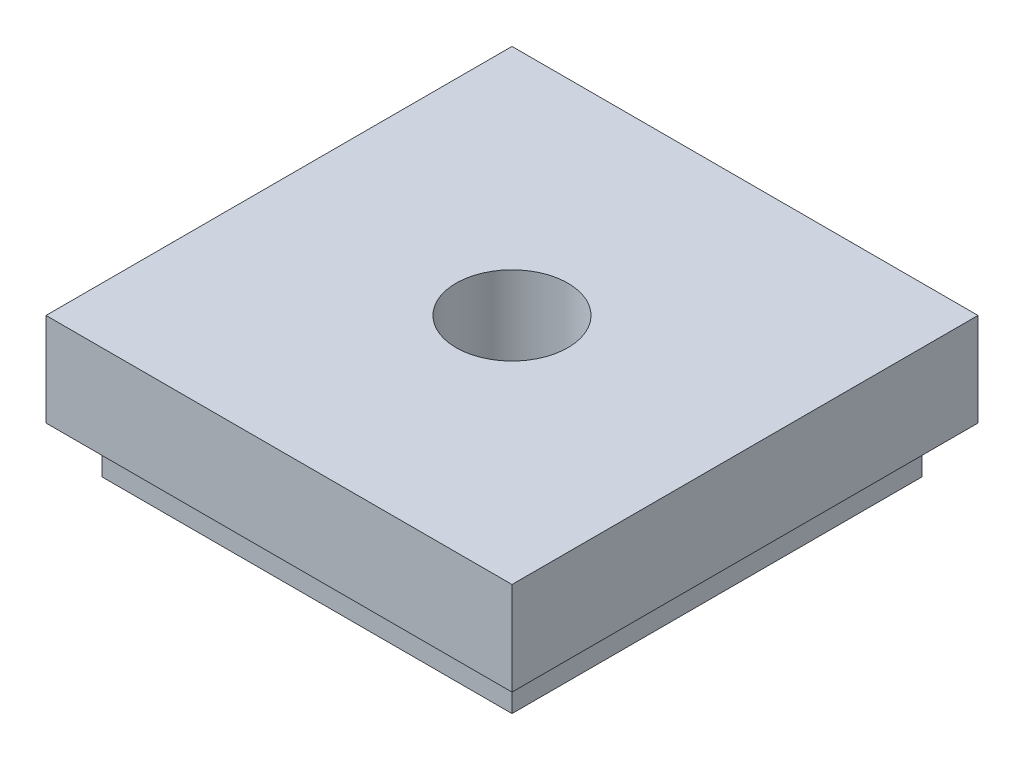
ISO-10303-21;
HEADER;
FILE_DESCRIPTION(('STEP AP214'),'2;1');
FILE_NAME('part.step','',(''),(''),'','','');
FILE_SCHEMA(('AUTOMOTIVE_DESIGN { 1 0 10303 214 1 1 1 1 }'));
ENDSEC;
DATA;
#1=APPLICATION_CONTEXT('core data for automotive mechanical design processes');
#2=APPLICATION_PROTOCOL_DEFINITION('international standard','automotive_design',2000,#1);
#3=PRODUCT_CONTEXT('',#1,'mechanical');
#4=PRODUCT('Part','Part','',(#3));
#5=PRODUCT_RELATED_PRODUCT_CATEGORY('part','',(#4));
#6=PRODUCT_DEFINITION_FORMATION('','',#4);
#7=PRODUCT_DEFINITION_CONTEXT('part definition',#1,'design');
#8=PRODUCT_DEFINITION('design','',#6,#7);
#9=PRODUCT_DEFINITION_SHAPE('','',#8);
#10=(LENGTH_UNIT() NAMED_UNIT(*) SI_UNIT(.MILLI.,.METRE.));
#11=(NAMED_UNIT(*) PLANE_ANGLE_UNIT() SI_UNIT($,.RADIAN.));
#12=(NAMED_UNIT(*) SI_UNIT($,.STERADIAN.) SOLID_ANGLE_UNIT());
#13=UNCERTAINTY_MEASURE_WITH_UNIT(LENGTH_MEASURE(1.E-05),#10,'distance_accuracy_value','');
#14=(GEOMETRIC_REPRESENTATION_CONTEXT(3) GLOBAL_UNCERTAINTY_ASSIGNED_CONTEXT((#13)) GLOBAL_UNIT_ASSIGNED_CONTEXT((#10,
#11,#12)) REPRESENTATION_CONTEXT('',''));
#15=CARTESIAN_POINT('',(0.,0.,0.));
#16=DIRECTION('',(0.,0.,1.));
#17=DIRECTION('',(1.,0.,0.));
#18=AXIS2_PLACEMENT_3D('',#15,#16,#17);
#19=CARTESIAN_POINT('',(50.,0.,0.));
#20=DIRECTION('',(0.,-1.,0.));
#21=DIRECTION('',(0.,0.,-1.));
#22=AXIS2_PLACEMENT_3D('',#19,#20,#21);
#23=PLANE('',#22);
#24=DIRECTION('',(0.,0.,-1.));
#25=VECTOR('',#24,1.);
#26=CARTESIAN_POINT('',(50.,0.,-50.));
#27=LINE('',#26,#25);
#28=CARTESIAN_POINT('',(50.,0.,0.));
#29=VERTEX_POINT('',#28);
#30=CARTESIAN_POINT('',(50.,0.,-50.));
#31=VERTEX_POINT('',#30);
#32=EDGE_CURVE('E190',#29,#31,#27,.T.);
#33=ORIENTED_EDGE('',*,*,#32,.F.);
#34=DIRECTION('',(1.,0.,0.));
#35=VECTOR('',#34,1.);
#36=CARTESIAN_POINT('',(50.,0.,0.));
#37=LINE('',#36,#35);
#38=CARTESIAN_POINT('',(0.,0.,0.));
#39=VERTEX_POINT('',#38);
#40=EDGE_CURVE('E195',#39,#29,#37,.T.);
#41=ORIENTED_EDGE('',*,*,#40,.F.);
#42=DIRECTION('',(0.,0.,1.));
#43=VECTOR('',#42,1.);
#44=CARTESIAN_POINT('',(0.,0.,-50.));
#45=LINE('',#44,#43);
#46=CARTESIAN_POINT('',(0.,0.,-50.));
#47=VERTEX_POINT('',#46);
#48=EDGE_CURVE('E206',#47,#39,#45,.T.);
#49=ORIENTED_EDGE('',*,*,#48,.F.);
#50=DIRECTION('',(-1.,0.,0.));
#51=VECTOR('',#50,1.);
#52=CARTESIAN_POINT('',(50.,0.,-50.));
#53=LINE('',#52,#51);
#54=EDGE_CURVE('E204',#31,#47,#53,.T.);
#55=ORIENTED_EDGE('',*,*,#54,.F.);
#56=EDGE_LOOP('',(#33,#41,#49,#55));
#57=FACE_BOUND('',#56,.T.);
#58=DIRECTION('',(1.,0.,0.));
#59=VECTOR('',#58,1.);
#60=CARTESIAN_POINT('',(3.,0.,-47.));
#61=LINE('',#60,#59);
#62=CARTESIAN_POINT('',(3.,0.,-47.));
#63=VERTEX_POINT('',#62);
#64=CARTESIAN_POINT('',(47.,0.,-47.));
#65=VERTEX_POINT('',#64);
#66=EDGE_CURVE('E177',#63,#65,#61,.T.);
#67=ORIENTED_EDGE('',*,*,#66,.F.);
#68=DIRECTION('',(0.,0.,-1.));
#69=VECTOR('',#68,1.);
#70=CARTESIAN_POINT('',(3.,0.,-3.));
#71=LINE('',#70,#69);
#72=CARTESIAN_POINT('',(3.,0.,-3.));
#73=VERTEX_POINT('',#72);
#74=EDGE_CURVE('E140',#73,#63,#71,.T.);
#75=ORIENTED_EDGE('',*,*,#74,.F.);
#76=DIRECTION('',(-1.,0.,0.));
#77=VECTOR('',#76,1.);
#78=CARTESIAN_POINT('',(3.,0.,-3.));
#79=LINE('',#78,#77);
#80=CARTESIAN_POINT('',(47.,0.,-3.));
#81=VERTEX_POINT('',#80);
#82=EDGE_CURVE('E168',#81,#73,#79,.T.);
#83=ORIENTED_EDGE('',*,*,#82,.F.);
#84=DIRECTION('',(0.,0.,1.));
#85=VECTOR('',#84,1.);
#86=CARTESIAN_POINT('',(47.,0.,-3.));
#87=LINE('',#86,#85);
#88=EDGE_CURVE('E179',#65,#81,#87,.T.);
#89=ORIENTED_EDGE('',*,*,#88,.F.);
#90=EDGE_LOOP('',(#67,#75,#83,#89));
#91=FACE_BOUND('',#90,.T.);
#92=ADVANCED_FACE('F32',(#57,#91),#23,.T.);
#93=CARTESIAN_POINT('',(50.,10.,-50.));
#94=DIRECTION('',(-1.,0.,0.));
#95=DIRECTION('',(0.,0.,1.));
#96=AXIS2_PLACEMENT_3D('',#93,#94,#95);
#97=PLANE('',#96);
#98=ORIENTED_EDGE('',*,*,#32,.T.);
#99=DIRECTION('',(0.,-1.,0.));
#100=VECTOR('',#99,1.);
#101=CARTESIAN_POINT('',(50.,10.,-50.));
#102=LINE('',#101,#100);
#103=CARTESIAN_POINT('',(50.,10.,-50.));
#104=VERTEX_POINT('',#103);
#105=EDGE_CURVE('E11',#104,#31,#102,.T.);
#106=ORIENTED_EDGE('',*,*,#105,.F.);
#107=DIRECTION('',(0.,0.,-1.));
#108=VECTOR('',#107,1.);
#109=CARTESIAN_POINT('',(50.,10.,-50.));
#110=LINE('',#109,#108);
#111=CARTESIAN_POINT('',(50.,10.,0.));
#112=VERTEX_POINT('',#111);
#113=EDGE_CURVE('E191',#112,#104,#110,.T.);
#114=ORIENTED_EDGE('',*,*,#113,.F.);
#115=DIRECTION('',(0.,-1.,0.));
#116=VECTOR('',#115,1.);
#117=CARTESIAN_POINT('',(50.,10.,0.));
#118=LINE('',#117,#116);
#119=EDGE_CURVE('E201',#112,#29,#118,.T.);
#120=ORIENTED_EDGE('',*,*,#119,.T.);
#121=EDGE_LOOP('',(#98,#106,#114,#120));
#122=FACE_BOUND('',#121,.T.);
#123=ADVANCED_FACE('F34',(#122),#97,.F.);
#124=CARTESIAN_POINT('',(50.,10.,-50.));
#125=DIRECTION('',(0.,0.,1.));
#126=DIRECTION('',(1.,0.,0.));
#127=AXIS2_PLACEMENT_3D('',#124,#125,#126);
#128=PLANE('',#127);
#129=ORIENTED_EDGE('',*,*,#54,.T.);
#130=DIRECTION('',(0.,-1.,0.));
#131=VECTOR('',#130,1.);
#132=CARTESIAN_POINT('',(0.,10.,-50.));
#133=LINE('',#132,#131);
#134=CARTESIAN_POINT('',(0.,10.,-50.));
#135=VERTEX_POINT('',#134);
#136=EDGE_CURVE('E40',#135,#47,#133,.T.);
#137=ORIENTED_EDGE('',*,*,#136,.F.);
#138=DIRECTION('',(-1.,0.,0.));
#139=VECTOR('',#138,1.);
#140=CARTESIAN_POINT('',(50.,10.,-50.));
#141=LINE('',#140,#139);
#142=EDGE_CURVE('E194',#104,#135,#141,.T.);
#143=ORIENTED_EDGE('',*,*,#142,.F.);
#144=ORIENTED_EDGE('',*,*,#105,.T.);
#145=EDGE_LOOP('',(#129,#137,#143,#144));
#146=FACE_BOUND('',#145,.T.);
#147=ADVANCED_FACE('F234',(#146),#128,.F.);
#148=CARTESIAN_POINT('',(0.,10.,-50.));
#149=DIRECTION('',(1.,0.,0.));
#150=DIRECTION('',(0.,0.,-1.));
#151=AXIS2_PLACEMENT_3D('',#148,#149,#150);
#152=PLANE('',#151);
#153=ORIENTED_EDGE('',*,*,#48,.T.);
#154=DIRECTION('',(0.,-1.,0.));
#155=VECTOR('',#154,1.);
#156=CARTESIAN_POINT('',(0.,10.,0.));
#157=LINE('',#156,#155);
#158=CARTESIAN_POINT('',(0.,10.,0.));
#159=VERTEX_POINT('',#158);
#160=EDGE_CURVE('E211',#159,#39,#157,.T.);
#161=ORIENTED_EDGE('',*,*,#160,.F.);
#162=DIRECTION('',(0.,0.,1.));
#163=VECTOR('',#162,1.);
#164=CARTESIAN_POINT('',(0.,10.,-50.));
#165=LINE('',#164,#163);
#166=EDGE_CURVE('E197',#135,#159,#165,.T.);
#167=ORIENTED_EDGE('',*,*,#166,.F.);
#168=ORIENTED_EDGE('',*,*,#136,.T.);
#169=EDGE_LOOP('',(#153,#161,#167,#168));
#170=FACE_BOUND('',#169,.T.);
#171=ADVANCED_FACE('F218',(#170),#152,.F.);
#172=CARTESIAN_POINT('',(50.,10.,0.));
#173=DIRECTION('',(0.,0.,-1.));
#174=DIRECTION('',(-1.,0.,0.));
#175=AXIS2_PLACEMENT_3D('',#172,#173,#174);
#176=PLANE('',#175);
#177=ORIENTED_EDGE('',*,*,#40,.T.);
#178=ORIENTED_EDGE('',*,*,#119,.F.);
#179=DIRECTION('',(1.,0.,0.));
#180=VECTOR('',#179,1.);
#181=CARTESIAN_POINT('',(50.,10.,0.));
#182=LINE('',#181,#180);
#183=EDGE_CURVE('E199',#159,#112,#182,.T.);
#184=ORIENTED_EDGE('',*,*,#183,.F.);
#185=ORIENTED_EDGE('',*,*,#160,.T.);
#186=EDGE_LOOP('',(#177,#178,#184,#185));
#187=FACE_BOUND('',#186,.T.);
#188=ADVANCED_FACE('F227',(#187),#176,.F.);
#189=CARTESIAN_POINT('',(50.,10.,0.));
#190=DIRECTION('',(0.,-1.,0.));
#191=DIRECTION('',(0.,0.,-1.));
#192=AXIS2_PLACEMENT_3D('',#189,#190,#191);
#193=PLANE('',#192);
#194=CARTESIAN_POINT('',(25.,10.,-25.));
#195=DIRECTION('',(0.,1.,0.));
#196=DIRECTION('',(0.,0.,1.));
#197=AXIS2_PLACEMENT_3D('',#194,#195,#196);
#198=CIRCLE('',#197,6.);
#199=CARTESIAN_POINT('',(25.,10.,-19.));
#200=VERTEX_POINT('',#199);
#201=EDGE_CURVE('E263',#200,#200,#198,.T.);
#202=ORIENTED_EDGE('',*,*,#201,.F.);
#203=EDGE_LOOP('',(#202));
#204=FACE_BOUND('',#203,.T.);
#205=ORIENTED_EDGE('',*,*,#113,.T.);
#206=ORIENTED_EDGE('',*,*,#142,.T.);
#207=ORIENTED_EDGE('',*,*,#166,.T.);
#208=ORIENTED_EDGE('',*,*,#183,.T.);
#209=EDGE_LOOP('',(#205,#206,#207,#208));
#210=FACE_BOUND('',#209,.T.);
#211=ADVANCED_FACE('F233',(#204,#210),#193,.F.);
#212=CARTESIAN_POINT('',(3.,-5.,-47.));
#213=DIRECTION('',(0.,-1.,0.));
#214=DIRECTION('',(0.,0.,-1.));
#215=AXIS2_PLACEMENT_3D('',#212,#213,#214);
#216=PLANE('',#215);
#217=DIRECTION('',(0.,0.,-1.));
#218=VECTOR('',#217,1.);
#219=CARTESIAN_POINT('',(3.,-5.,-3.));
#220=LINE('',#219,#218);
#221=CARTESIAN_POINT('',(3.,-5.,-3.));
#222=VERTEX_POINT('',#221);
#223=CARTESIAN_POINT('',(3.,-5.,-47.));
#224=VERTEX_POINT('',#223);
#225=EDGE_CURVE('E164',#222,#224,#220,.T.);
#226=ORIENTED_EDGE('',*,*,#225,.T.);
#227=DIRECTION('',(1.,0.,0.));
#228=VECTOR('',#227,1.);
#229=CARTESIAN_POINT('',(3.,-5.,-47.));
#230=LINE('',#229,#228);
#231=CARTESIAN_POINT('',(47.,-5.,-47.));
#232=VERTEX_POINT('',#231);
#233=EDGE_CURVE('E167',#224,#232,#230,.T.);
#234=ORIENTED_EDGE('',*,*,#233,.T.);
#235=DIRECTION('',(0.,0.,1.));
#236=VECTOR('',#235,1.);
#237=CARTESIAN_POINT('',(47.,-5.,-3.));
#238=LINE('',#237,#236);
#239=CARTESIAN_POINT('',(47.,-5.,-3.));
#240=VERTEX_POINT('',#239);
#241=EDGE_CURVE('E170',#232,#240,#238,.T.);
#242=ORIENTED_EDGE('',*,*,#241,.T.);
#243=DIRECTION('',(-1.,0.,0.));
#244=VECTOR('',#243,1.);
#245=CARTESIAN_POINT('',(3.,-5.,-3.));
#246=LINE('',#245,#244);
#247=EDGE_CURVE('E172',#240,#222,#246,.T.);
#248=ORIENTED_EDGE('',*,*,#247,.T.);
#249=EDGE_LOOP('',(#226,#234,#242,#248));
#250=FACE_BOUND('',#249,.T.);
#251=DIRECTION('',(1.,0.,0.));
#252=VECTOR('',#251,1.);
#253=CARTESIAN_POINT('',(5.,-5.,-45.));
#254=LINE('',#253,#252);
#255=CARTESIAN_POINT('',(5.,-5.,-45.));
#256=VERTEX_POINT('',#255);
#257=CARTESIAN_POINT('',(45.,-5.,-45.));
#258=VERTEX_POINT('',#257);
#259=EDGE_CURVE('E132',#256,#258,#254,.T.);
#260=ORIENTED_EDGE('',*,*,#259,.F.);
#261=DIRECTION('',(0.,0.,-1.));
#262=VECTOR('',#261,1.);
#263=CARTESIAN_POINT('',(5.,-5.,-5.));
#264=LINE('',#263,#262);
#265=CARTESIAN_POINT('',(5.,-5.,-5.));
#266=VERTEX_POINT('',#265);
#267=EDGE_CURVE('E123',#266,#256,#264,.T.);
#268=ORIENTED_EDGE('',*,*,#267,.F.);
#269=DIRECTION('',(-1.,0.,0.));
#270=VECTOR('',#269,1.);
#271=CARTESIAN_POINT('',(5.,-5.,-5.));
#272=LINE('',#271,#270);
#273=CARTESIAN_POINT('',(45.,-5.,-5.));
#274=VERTEX_POINT('',#273);
#275=EDGE_CURVE('E148',#274,#266,#272,.T.);
#276=ORIENTED_EDGE('',*,*,#275,.F.);
#277=DIRECTION('',(0.,0.,1.));
#278=VECTOR('',#277,1.);
#279=CARTESIAN_POINT('',(45.,-5.,-5.));
#280=LINE('',#279,#278);
#281=EDGE_CURVE('E146',#258,#274,#280,.T.);
#282=ORIENTED_EDGE('',*,*,#281,.F.);
#283=EDGE_LOOP('',(#260,#268,#276,#282));
#284=FACE_BOUND('',#283,.T.);
#285=ADVANCED_FACE('F144',(#250,#284),#216,.T.);
#286=CARTESIAN_POINT('',(3.,-5.,-3.));
#287=DIRECTION('',(1.,0.,0.));
#288=DIRECTION('',(0.,0.,-1.));
#289=AXIS2_PLACEMENT_3D('',#286,#287,#288);
#290=PLANE('',#289);
#291=ORIENTED_EDGE('',*,*,#74,.T.);
#292=DIRECTION('',(0.,1.,0.));
#293=VECTOR('',#292,1.);
#294=CARTESIAN_POINT('',(3.,-5.,-47.));
#295=LINE('',#294,#293);
#296=EDGE_CURVE('E188',#224,#63,#295,.T.);
#297=ORIENTED_EDGE('',*,*,#296,.F.);
#298=ORIENTED_EDGE('',*,*,#225,.F.);
#299=DIRECTION('',(0.,1.,0.));
#300=VECTOR('',#299,1.);
#301=CARTESIAN_POINT('',(3.,-5.,-3.));
#302=LINE('',#301,#300);
#303=EDGE_CURVE('E174',#222,#73,#302,.T.);
#304=ORIENTED_EDGE('',*,*,#303,.T.);
#305=EDGE_LOOP('',(#291,#297,#298,#304));
#306=FACE_BOUND('',#305,.T.);
#307=ADVANCED_FACE('F274',(#306),#290,.F.);
#308=CARTESIAN_POINT('',(3.,-5.,-47.));
#309=DIRECTION('',(0.,0.,1.));
#310=DIRECTION('',(1.,0.,0.));
#311=AXIS2_PLACEMENT_3D('',#308,#309,#310);
#312=PLANE('',#311);
#313=ORIENTED_EDGE('',*,*,#66,.T.);
#314=DIRECTION('',(0.,1.,0.));
#315=VECTOR('',#314,1.);
#316=CARTESIAN_POINT('',(47.,-5.,-47.));
#317=LINE('',#316,#315);
#318=EDGE_CURVE('E185',#232,#65,#317,.T.);
#319=ORIENTED_EDGE('',*,*,#318,.F.);
#320=ORIENTED_EDGE('',*,*,#233,.F.);
#321=ORIENTED_EDGE('',*,*,#296,.T.);
#322=EDGE_LOOP('',(#313,#319,#320,#321));
#323=FACE_BOUND('',#322,.T.);
#324=ADVANCED_FACE('F280',(#323),#312,.F.);
#325=CARTESIAN_POINT('',(47.,-5.,-3.));
#326=DIRECTION('',(-1.,0.,0.));
#327=DIRECTION('',(0.,0.,1.));
#328=AXIS2_PLACEMENT_3D('',#325,#326,#327);
#329=PLANE('',#328);
#330=ORIENTED_EDGE('',*,*,#88,.T.);
#331=DIRECTION('',(0.,1.,0.));
#332=VECTOR('',#331,1.);
#333=CARTESIAN_POINT('',(47.,-5.,-3.));
#334=LINE('',#333,#332);
#335=EDGE_CURVE('E47',#240,#81,#334,.T.);
#336=ORIENTED_EDGE('',*,*,#335,.F.);
#337=ORIENTED_EDGE('',*,*,#241,.F.);
#338=ORIENTED_EDGE('',*,*,#318,.T.);
#339=EDGE_LOOP('',(#330,#336,#337,#338));
#340=FACE_BOUND('',#339,.T.);
#341=ADVANCED_FACE('F284',(#340),#329,.F.);
#342=CARTESIAN_POINT('',(3.,-5.,-3.));
#343=DIRECTION('',(0.,0.,-1.));
#344=DIRECTION('',(-1.,0.,0.));
#345=AXIS2_PLACEMENT_3D('',#342,#343,#344);
#346=PLANE('',#345);
#347=ORIENTED_EDGE('',*,*,#82,.T.);
#348=ORIENTED_EDGE('',*,*,#303,.F.);
#349=ORIENTED_EDGE('',*,*,#247,.F.);
#350=ORIENTED_EDGE('',*,*,#335,.T.);
#351=EDGE_LOOP('',(#347,#348,#349,#350));
#352=FACE_BOUND('',#351,.T.);
#353=ADVANCED_FACE('F288',(#352),#346,.F.);
#354=CARTESIAN_POINT('',(5.,-5.,-5.));
#355=DIRECTION('',(1.,0.,0.));
#356=DIRECTION('',(0.,0.,-1.));
#357=AXIS2_PLACEMENT_3D('',#354,#355,#356);
#358=PLANE('',#357);
#359=DIRECTION('',(0.,0.,-1.));
#360=VECTOR('',#359,1.);
#361=CARTESIAN_POINT('',(5.,0.,-5.));
#362=LINE('',#361,#360);
#363=CARTESIAN_POINT('',(5.,0.,-5.));
#364=VERTEX_POINT('',#363);
#365=CARTESIAN_POINT('',(5.,0.,-45.));
#366=VERTEX_POINT('',#365);
#367=EDGE_CURVE('E55',#364,#366,#362,.T.);
#368=ORIENTED_EDGE('',*,*,#367,.F.);
#369=DIRECTION('',(0.,1.,0.));
#370=VECTOR('',#369,1.);
#371=CARTESIAN_POINT('',(5.,-5.,-5.));
#372=LINE('',#371,#370);
#373=EDGE_CURVE('E128',#266,#364,#372,.T.);
#374=ORIENTED_EDGE('',*,*,#373,.F.);
#375=ORIENTED_EDGE('',*,*,#267,.T.);
#376=DIRECTION('',(0.,1.,0.));
#377=VECTOR('',#376,1.);
#378=CARTESIAN_POINT('',(5.,-5.,-45.));
#379=LINE('',#378,#377);
#380=EDGE_CURVE('E126',#256,#366,#379,.T.);
#381=ORIENTED_EDGE('',*,*,#380,.T.);
#382=EDGE_LOOP('',(#368,#374,#375,#381));
#383=FACE_BOUND('',#382,.T.);
#384=ADVANCED_FACE('F125',(#383),#358,.T.);
#385=CARTESIAN_POINT('',(5.,-5.,-45.));
#386=DIRECTION('',(0.,0.,1.));
#387=DIRECTION('',(1.,0.,0.));
#388=AXIS2_PLACEMENT_3D('',#385,#386,#387);
#389=PLANE('',#388);
#390=DIRECTION('',(1.,0.,0.));
#391=VECTOR('',#390,1.);
#392=CARTESIAN_POINT('',(5.,0.,-45.));
#393=LINE('',#392,#391);
#394=CARTESIAN_POINT('',(45.,0.,-45.));
#395=VERTEX_POINT('',#394);
#396=EDGE_CURVE('E139',#366,#395,#393,.T.);
#397=ORIENTED_EDGE('',*,*,#396,.F.);
#398=ORIENTED_EDGE('',*,*,#380,.F.);
#399=ORIENTED_EDGE('',*,*,#259,.T.);
#400=DIRECTION('',(0.,1.,0.));
#401=VECTOR('',#400,1.);
#402=CARTESIAN_POINT('',(45.,-5.,-45.));
#403=LINE('',#402,#401);
#404=EDGE_CURVE('E141',#258,#395,#403,.T.);
#405=ORIENTED_EDGE('',*,*,#404,.T.);
#406=EDGE_LOOP('',(#397,#398,#399,#405));
#407=FACE_BOUND('',#406,.T.);
#408=ADVANCED_FACE('F136',(#407),#389,.T.);
#409=CARTESIAN_POINT('',(45.,-5.,-5.));
#410=DIRECTION('',(-1.,0.,0.));
#411=DIRECTION('',(0.,0.,1.));
#412=AXIS2_PLACEMENT_3D('',#409,#410,#411);
#413=PLANE('',#412);
#414=DIRECTION('',(0.,0.,1.));
#415=VECTOR('',#414,1.);
#416=CARTESIAN_POINT('',(45.,0.,-5.));
#417=LINE('',#416,#415);
#418=CARTESIAN_POINT('',(45.,0.,-5.));
#419=VERTEX_POINT('',#418);
#420=EDGE_CURVE('E156',#395,#419,#417,.T.);
#421=ORIENTED_EDGE('',*,*,#420,.F.);
#422=ORIENTED_EDGE('',*,*,#404,.F.);
#423=ORIENTED_EDGE('',*,*,#281,.T.);
#424=DIRECTION('',(0.,1.,0.));
#425=VECTOR('',#424,1.);
#426=CARTESIAN_POINT('',(45.,-5.,-5.));
#427=LINE('',#426,#425);
#428=EDGE_CURVE('E160',#274,#419,#427,.T.);
#429=ORIENTED_EDGE('',*,*,#428,.T.);
#430=EDGE_LOOP('',(#421,#422,#423,#429));
#431=FACE_BOUND('',#430,.T.);
#432=ADVANCED_FACE('F258',(#431),#413,.T.);
#433=CARTESIAN_POINT('',(5.,-5.,-5.));
#434=DIRECTION('',(0.,0.,-1.));
#435=DIRECTION('',(-1.,0.,0.));
#436=AXIS2_PLACEMENT_3D('',#433,#434,#435);
#437=PLANE('',#436);
#438=DIRECTION('',(-1.,0.,0.));
#439=VECTOR('',#438,1.);
#440=CARTESIAN_POINT('',(5.,0.,-5.));
#441=LINE('',#440,#439);
#442=EDGE_CURVE('E133',#419,#364,#441,.T.);
#443=ORIENTED_EDGE('',*,*,#442,.F.);
#444=ORIENTED_EDGE('',*,*,#428,.F.);
#445=ORIENTED_EDGE('',*,*,#275,.T.);
#446=ORIENTED_EDGE('',*,*,#373,.T.);
#447=EDGE_LOOP('',(#443,#444,#445,#446));
#448=FACE_BOUND('',#447,.T.);
#449=ADVANCED_FACE('F250',(#448),#437,.T.);
#450=CARTESIAN_POINT('',(25.,0.,-25.));
#451=DIRECTION('',(0.,1.,0.));
#452=DIRECTION('',(0.,0.,1.));
#453=AXIS2_PLACEMENT_3D('',#450,#451,#452);
#454=CIRCLE('',#453,6.);
#455=CARTESIAN_POINT('',(25.,0.,-19.));
#456=VERTEX_POINT('',#455);
#457=EDGE_CURVE('E154',#456,#456,#454,.T.);
#458=ORIENTED_EDGE('',*,*,#457,.T.);
#459=EDGE_LOOP('',(#458));
#460=FACE_BOUND('',#459,.T.);
#461=ORIENTED_EDGE('',*,*,#367,.T.);
#462=ORIENTED_EDGE('',*,*,#396,.T.);
#463=ORIENTED_EDGE('',*,*,#420,.T.);
#464=ORIENTED_EDGE('',*,*,#442,.T.);
#465=EDGE_LOOP('',(#461,#462,#463,#464));
#466=FACE_BOUND('',#465,.T.);
#467=ADVANCED_FACE('F243',(#460,#466),#23,.T.);
#468=CARTESIAN_POINT('',(25.,0.,-25.));
#469=DIRECTION('',(0.,1.,0.));
#470=DIRECTION('',(0.,0.,1.));
#471=AXIS2_PLACEMENT_3D('',#468,#469,#470);
#472=CYLINDRICAL_SURFACE('',#471,6.);
#473=ORIENTED_EDGE('',*,*,#457,.F.);
#474=EDGE_LOOP('',(#473));
#475=FACE_BOUND('',#474,.T.);
#476=ORIENTED_EDGE('',*,*,#201,.T.);
#477=EDGE_LOOP('',(#476));
#478=FACE_BOUND('',#477,.T.);
#479=ADVANCED_FACE('F249',(#475,#478),#472,.F.);
#480=CLOSED_SHELL('',(#92,#123,#147,#171,#188,#211,#285,#307,#324,#341,#353,#384,#408,#432,#449,
#467,#479));
#481=MANIFOLD_SOLID_BREP('B2',#480);
#482=ADVANCED_BREP_SHAPE_REPRESENTATION('',(#18,#481),#14);
#483=SHAPE_DEFINITION_REPRESENTATION(#9,#482);
ENDSEC;
END-ISO-10303-21;
